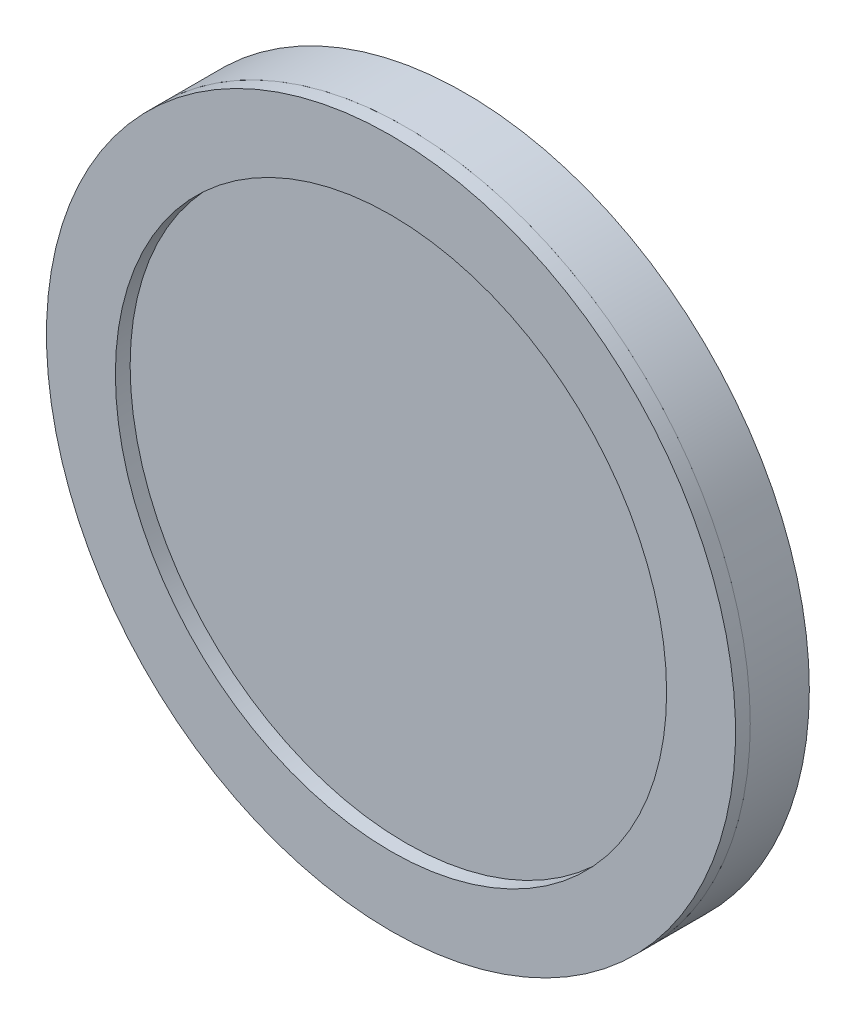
from build123d import *

# Parameters (mm, degrees)
SKETCH_1_R      = 17.5
EXTRUDE_1_DEPTH = 3
SKETCH_2_R      = 17.5
SKETCH_2_R_2    = 14
EXTRUDE_2_DEPTH = 0.75


with BuildPart() as part:
    # Sketch 1 → Extrude 1 (new body)
    with BuildSketch(Plane.XY):
        with Locations((-3, 52)):
            Circle(SKETCH_1_R)
    extrude(amount=EXTRUDE_1_DEPTH)


with BuildPart() as body_2:
    # Sketch 2 → Extrude 2 (new body)
    with BuildSketch(Plane.XY.offset(3)):
        with Locations(Location((-3, 52, 0), (0, 0, 270))):
            Circle(SKETCH_2_R)
        with Locations(Location((-3, 52, 0), (0, 0, 270))):
            Circle(SKETCH_2_R_2, mode=Mode.SUBTRACT)
    extrude(amount=EXTRUDE_2_DEPTH)


solid = Compound([part.part, body_2.part])
